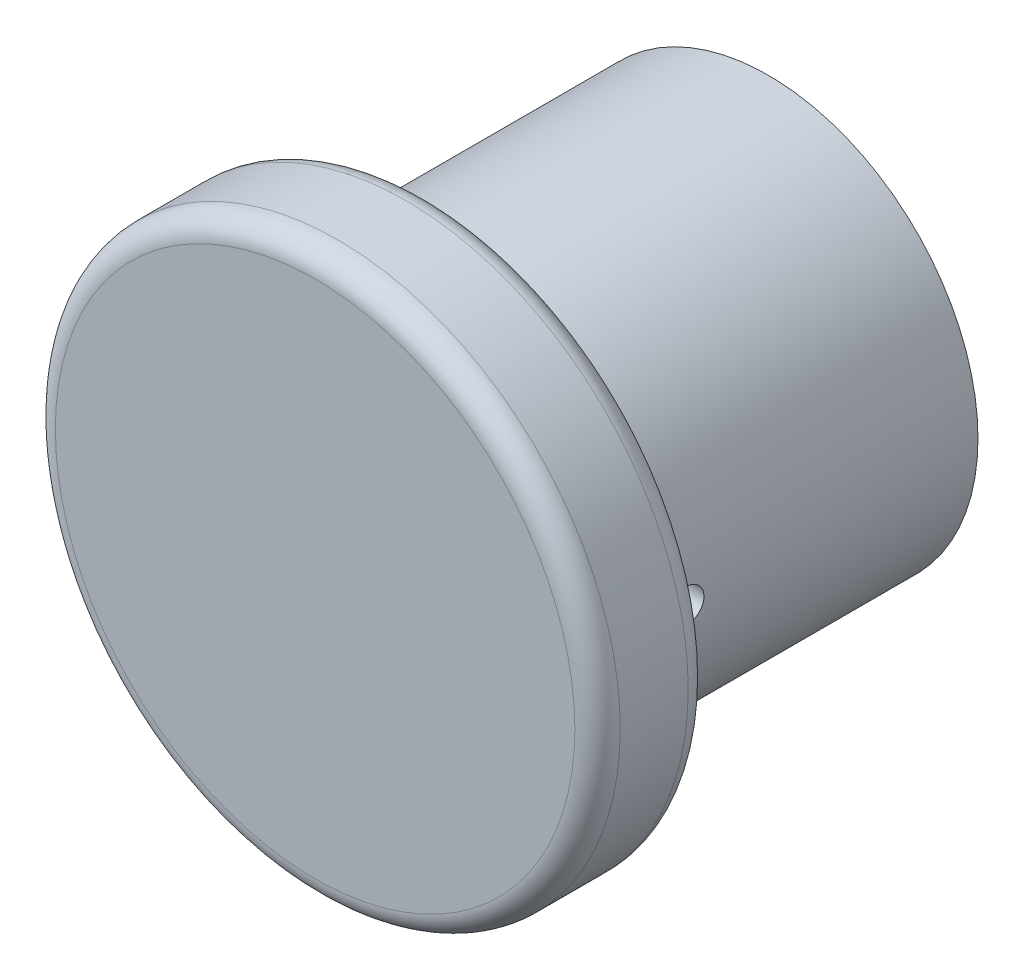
from build123d import *

# Parameters (mm, degrees)
SKETCH1_R           = 12.461427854
BASE_EXTRUDE_DEPTH  = 5
SKETCH2_R           = 9.246210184
BOSS_EXTRUDE1_DEPTH = 15
SKETCH3_W           = 6.4135
SKETCH3_H           = 13.726679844
SKETCH4_W           = 2.875338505
SKETCH4_H           = 0.738225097
SKETCH5_W           = 2.875338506
SKETCH5_H           = 0.738225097
FILLET1_R           = 1


with BuildPart() as part:
    # Sketch1 → Base-Extrude (new body)
    with BuildSketch(Plane(origin=(0, 0, 0), x_dir=(-1, 0, 0), z_dir=(0, 0, -1))):
        with Locations(Location((0, 0, 0), (0, 0, 180))):
            Circle(SKETCH1_R)
    extrude(amount=-BASE_EXTRUDE_DEPTH)

    # Sketch2 → Boss-Extrude1 (add)
    with BuildSketch(Plane(origin=(0, 0, 0), x_dir=(-1, 0, 0), z_dir=(0, 0, -1))):
        with Locations(Location((0, 0, 0), (0, 0, 180))):
            Circle(SKETCH2_R)
    extrude(amount=BOSS_EXTRUDE1_DEPTH)

    # Sketch3 → Cut-Revolve1 (revolve, cut)
    with BuildSketch(Plane.XZ, mode=Mode.PRIVATE) as cut_revolve1_sk:
        with Locations((3.20675, -8.136660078)):
            Rectangle(SKETCH3_W, SKETCH3_H)
    revolve(cut_revolve1_sk.sketch.rotate(Axis((0, 0, -1.273320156), (0, 0, -1)), 180), axis=Axis((0, 0, -1.273320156), (0, 0, -1)), mode=Mode.SUBTRACT)

    # Sketch4 → Cut-Revolve2 (revolve, cut)
    with BuildSketch(Plane(origin=(0, 0, 0), x_dir=(1, 0, 0), z_dir=(0, 1, 0))):
        with Locations((-7.808540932, 2.539892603)):
            Rectangle(SKETCH4_W, SKETCH4_H)
    revolve(axis=Axis((-9.246210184, 0, -2.170780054), (1, 0, 0)), mode=Mode.SUBTRACT)

    # Sketch5 → Cut-Revolve3 (revolve, cut)
    with BuildSketch(Plane(origin=(0, 0, 0), x_dir=(1, 0, 0), z_dir=(0, 1, 0))):
        with Locations((7.808540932, 2.539892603)):
            Rectangle(SKETCH5_W, SKETCH5_H)
    revolve(axis=Axis((6.370871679, 0, -2.170780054), (1, 0, 0)), mode=Mode.SUBTRACT)

    # Fillet1
    fillet1_edges = [part.edges().sort_by_distance(p)[0] for p in [
        (-12.461427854, 0, 0),
        (-12.461427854, 0, 5),
        (-9.246210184, 0, 0),
    ]]
    fillet(fillet1_edges, radius=FILLET1_R)


solid = part.part
